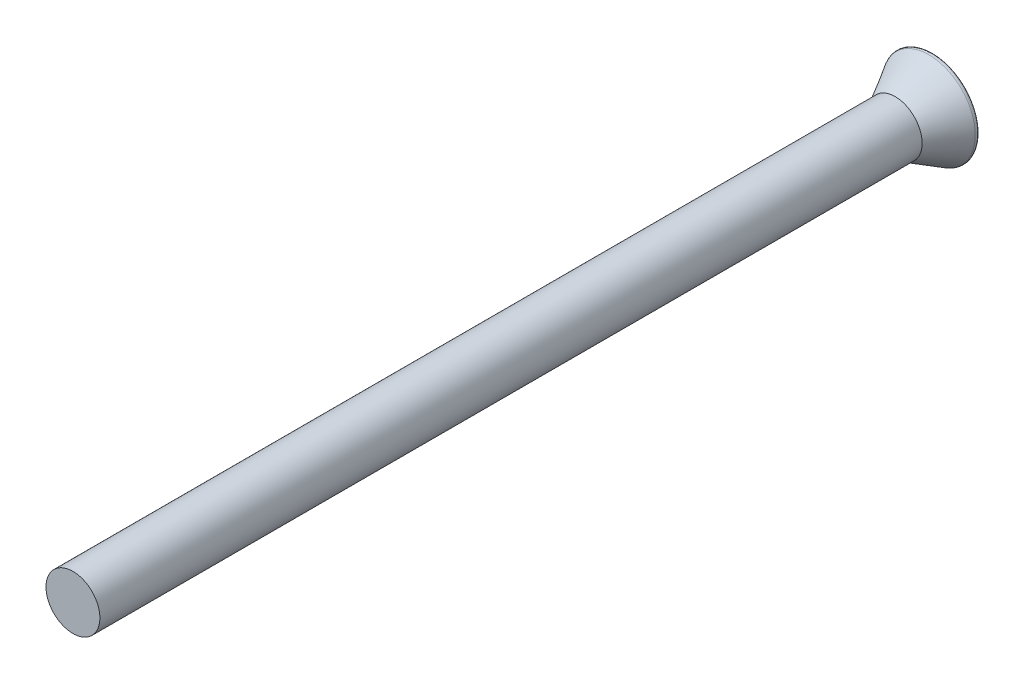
ISO-10303-21;
HEADER;
FILE_DESCRIPTION(('STEP AP214'),'2;1');
FILE_NAME('part.step','',(''),(''),'','','');
FILE_SCHEMA(('AUTOMOTIVE_DESIGN { 1 0 10303 214 1 1 1 1 }'));
ENDSEC;
DATA;
#1=APPLICATION_CONTEXT('core data for automotive mechanical design processes');
#2=APPLICATION_PROTOCOL_DEFINITION('international standard','automotive_design',2000,#1);
#3=PRODUCT_CONTEXT('',#1,'mechanical');
#4=PRODUCT('Part','Part','',(#3));
#5=PRODUCT_RELATED_PRODUCT_CATEGORY('part','',(#4));
#6=PRODUCT_DEFINITION_FORMATION('','',#4);
#7=PRODUCT_DEFINITION_CONTEXT('part definition',#1,'design');
#8=PRODUCT_DEFINITION('design','',#6,#7);
#9=PRODUCT_DEFINITION_SHAPE('','',#8);
#10=(LENGTH_UNIT() NAMED_UNIT(*) SI_UNIT(.MILLI.,.METRE.));
#11=(NAMED_UNIT(*) PLANE_ANGLE_UNIT() SI_UNIT($,.RADIAN.));
#12=(NAMED_UNIT(*) SI_UNIT($,.STERADIAN.) SOLID_ANGLE_UNIT());
#13=UNCERTAINTY_MEASURE_WITH_UNIT(LENGTH_MEASURE(1.E-05),#10,'distance_accuracy_value','');
#14=(GEOMETRIC_REPRESENTATION_CONTEXT(3) GLOBAL_UNCERTAINTY_ASSIGNED_CONTEXT((#13)) GLOBAL_UNIT_ASSIGNED_CONTEXT((#10,
#11,#12)) REPRESENTATION_CONTEXT('',''));
#15=CARTESIAN_POINT('',(0.,0.,0.));
#16=DIRECTION('',(0.,0.,1.));
#17=DIRECTION('',(1.,0.,0.));
#18=AXIS2_PLACEMENT_3D('',#15,#16,#17);
#19=CARTESIAN_POINT('',(0.,0.,0.));
#20=DIRECTION('',(0.,0.,1.));
#21=DIRECTION('',(1.,0.,0.));
#22=AXIS2_PLACEMENT_3D('',#19,#20,#21);
#23=PLANE('',#22);
#24=CARTESIAN_POINT('',(0.,0.,0.));
#25=DIRECTION('',(0.,0.,-1.));
#26=DIRECTION('',(-1.,0.,0.));
#27=AXIS2_PLACEMENT_3D('',#24,#25,#26);
#28=CIRCLE('',#27,1.95196482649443);
#29=CARTESIAN_POINT('',(-1.95196482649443,0.,0.));
#30=VERTEX_POINT('',#29);
#31=EDGE_CURVE('E10',#30,#30,#28,.T.);
#32=ORIENTED_EDGE('',*,*,#31,.T.);
#33=EDGE_LOOP('',(#32));
#34=FACE_BOUND('',#33,.T.);
#35=ADVANCED_FACE('F39',(#34),#23,.F.);
#36=CARTESIAN_POINT('',(0.,0.,0.119379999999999));
#37=DIRECTION('',(0.,0.,-1.));
#38=DIRECTION('',(-1.,0.,0.));
#39=AXIS2_PLACEMENT_3D('',#36,#37,#38);
#40=TOROIDAL_SURFACE('',#39,1.95196482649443,0.119379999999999);
#41=ORIENTED_EDGE('',*,*,#31,.F.);
#42=EDGE_LOOP('',(#41));
#43=FACE_BOUND('',#42,.T.);
#44=CARTESIAN_POINT('',(0.,0.,0.17907));
#45=DIRECTION('',(0.,0.,-1.));
#46=DIRECTION('',(-1.,0.,0.));
#47=AXIS2_PLACEMENT_3D('',#44,#45,#46);
#48=CIRCLE('',#47,2.05535093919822);
#49=CARTESIAN_POINT('',(-2.05535093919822,0.,0.17907));
#50=VERTEX_POINT('',#49);
#51=EDGE_CURVE('E45',#50,#50,#48,.T.);
#52=ORIENTED_EDGE('',*,*,#51,.T.);
#53=EDGE_LOOP('',(#52));
#54=FACE_BOUND('',#53,.T.);
#55=ADVANCED_FACE('F71',(#43,#54),#40,.T.);
#56=CARTESIAN_POINT('',(0.,0.,1.67132));
#57=DIRECTION('',(0.,0.,-1.));
#58=DIRECTION('',(-1.,0.,0.));
#59=AXIS2_PLACEMENT_3D('',#56,#57,#58);
#60=CONICAL_SURFACE('',#59,1.1938,0.523598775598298);
#61=ORIENTED_EDGE('',*,*,#51,.F.);
#62=EDGE_LOOP('',(#61));
#63=FACE_BOUND('',#62,.T.);
#64=CARTESIAN_POINT('',(0.,0.,1.67132));
#65=DIRECTION('',(0.,0.,-1.));
#66=DIRECTION('',(-1.,0.,0.));
#67=AXIS2_PLACEMENT_3D('',#64,#65,#66);
#68=CIRCLE('',#67,1.1938);
#69=CARTESIAN_POINT('',(-1.1938,0.,1.67132));
#70=VERTEX_POINT('',#69);
#71=EDGE_CURVE('E49',#70,#70,#68,.T.);
#72=ORIENTED_EDGE('',*,*,#71,.T.);
#73=EDGE_LOOP('',(#72));
#74=FACE_BOUND('',#73,.T.);
#75=ADVANCED_FACE('F67',(#63,#74),#60,.T.);
#76=CARTESIAN_POINT('',(0.,0.,-16.5467541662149));
#77=DIRECTION('',(0.,0.,-1.));
#78=DIRECTION('',(-1.,0.,0.));
#79=AXIS2_PLACEMENT_3D('',#76,#77,#78);
#80=CYLINDRICAL_SURFACE('',#79,1.1938);
#81=ORIENTED_EDGE('',*,*,#71,.F.);
#82=EDGE_LOOP('',(#81));
#83=FACE_BOUND('',#82,.T.);
#84=CARTESIAN_POINT('',(0.,0.,38.1));
#85=DIRECTION('',(0.,0.,-1.));
#86=DIRECTION('',(-1.,0.,0.));
#87=AXIS2_PLACEMENT_3D('',#84,#85,#86);
#88=CIRCLE('',#87,1.1938);
#89=CARTESIAN_POINT('',(-1.19380000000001,0.,38.1));
#90=VERTEX_POINT('',#89);
#91=EDGE_CURVE('E53',#90,#90,#88,.T.);
#92=ORIENTED_EDGE('',*,*,#91,.T.);
#93=EDGE_LOOP('',(#92));
#94=FACE_BOUND('',#93,.T.);
#95=ADVANCED_FACE('F59',(#83,#94),#80,.T.);
#96=CARTESIAN_POINT('',(0.,0.,38.1));
#97=DIRECTION('',(0.,0.,-1.));
#98=DIRECTION('',(-1.,0.,0.));
#99=AXIS2_PLACEMENT_3D('',#96,#97,#98);
#100=PLANE('',#99);
#101=ORIENTED_EDGE('',*,*,#91,.F.);
#102=EDGE_LOOP('',(#101));
#103=FACE_BOUND('',#102,.T.);
#104=ADVANCED_FACE('F61',(#103),#100,.F.);
#105=CLOSED_SHELL('',(#35,#55,#75,#95,#104));
#106=MANIFOLD_SOLID_BREP('B2',#105);
#107=ADVANCED_BREP_SHAPE_REPRESENTATION('',(#18,#106),#14);
#108=SHAPE_DEFINITION_REPRESENTATION(#9,#107);
ENDSEC;
END-ISO-10303-21;
